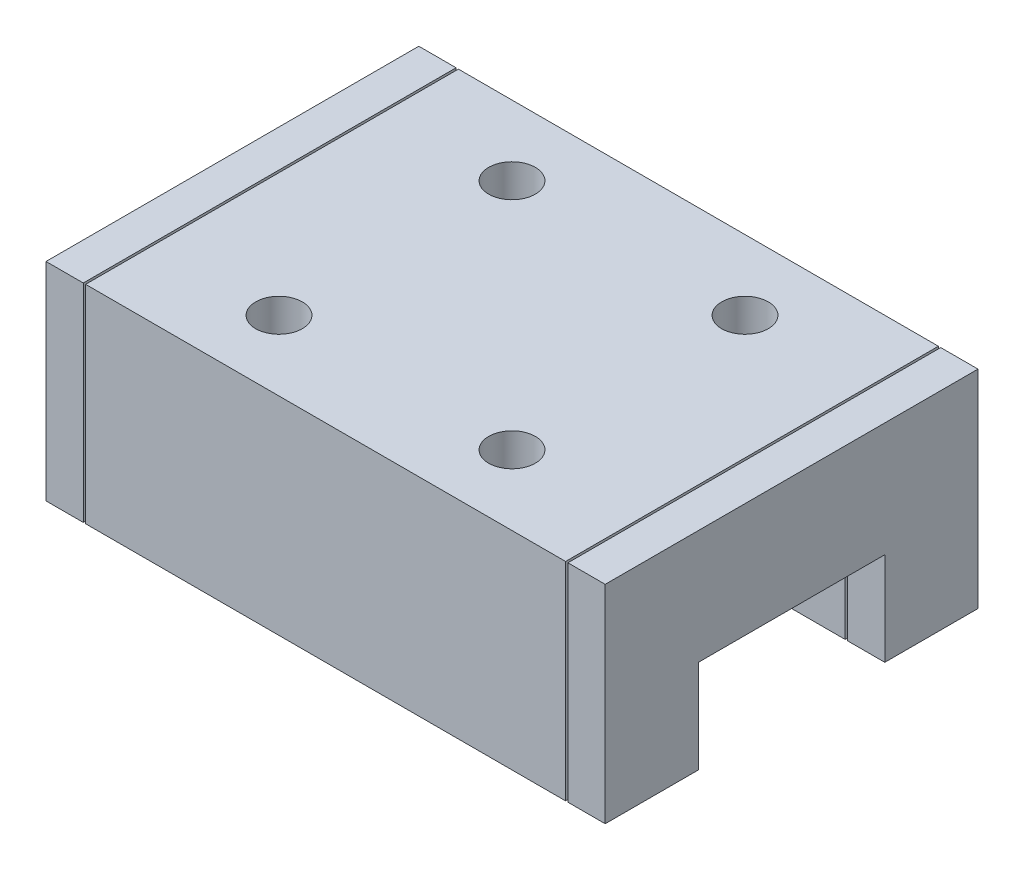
ISO-10303-21;
HEADER;
FILE_DESCRIPTION(('STEP AP214'),'2;1');
FILE_NAME('part.step','',(''),(''),'','','');
FILE_SCHEMA(('AUTOMOTIVE_DESIGN { 1 0 10303 214 1 1 1 1 }'));
ENDSEC;
DATA;
#1=APPLICATION_CONTEXT('core data for automotive mechanical design processes');
#2=APPLICATION_PROTOCOL_DEFINITION('international standard','automotive_design',2000,#1);
#3=PRODUCT_CONTEXT('',#1,'mechanical');
#4=PRODUCT('Part','Part','',(#3));
#5=PRODUCT_RELATED_PRODUCT_CATEGORY('part','',(#4));
#6=PRODUCT_DEFINITION_FORMATION('','',#4);
#7=PRODUCT_DEFINITION_CONTEXT('part definition',#1,'design');
#8=PRODUCT_DEFINITION('design','',#6,#7);
#9=PRODUCT_DEFINITION_SHAPE('','',#8);
#10=(LENGTH_UNIT() NAMED_UNIT(*) SI_UNIT(.MILLI.,.METRE.));
#11=(NAMED_UNIT(*) PLANE_ANGLE_UNIT() SI_UNIT($,.RADIAN.));
#12=(NAMED_UNIT(*) SI_UNIT($,.STERADIAN.) SOLID_ANGLE_UNIT());
#13=UNCERTAINTY_MEASURE_WITH_UNIT(LENGTH_MEASURE(1.E-05),#10,'distance_accuracy_value','');
#14=(GEOMETRIC_REPRESENTATION_CONTEXT(3) GLOBAL_UNCERTAINTY_ASSIGNED_CONTEXT((#13)) GLOBAL_UNIT_ASSIGNED_CONTEXT((#10,
#11,#12)) REPRESENTATION_CONTEXT('',''));
#15=CARTESIAN_POINT('',(0.,0.,0.));
#16=DIRECTION('',(0.,0.,1.));
#17=DIRECTION('',(1.,0.,0.));
#18=AXIS2_PLACEMENT_3D('',#15,#16,#17);
#19=CARTESIAN_POINT('',(12.,2.1,-8.));
#20=DIRECTION('',(0.,-1.,0.));
#21=DIRECTION('',(0.,0.,-1.));
#22=AXIS2_PLACEMENT_3D('',#19,#20,#21);
#23=PLANE('',#22);
#24=DIRECTION('',(-1.,0.,0.));
#25=VECTOR('',#24,1.);
#26=CARTESIAN_POINT('',(12.,2.1,-8.));
#27=LINE('',#26,#25);
#28=CARTESIAN_POINT('',(10.3,2.1,-8.));
#29=VERTEX_POINT('',#28);
#30=CARTESIAN_POINT('',(-10.3,2.1,-8.));
#31=VERTEX_POINT('',#30);
#32=EDGE_CURVE('P0_E84',#29,#31,#27,.T.);
#33=ORIENTED_EDGE('',*,*,#32,.F.);
#34=DIRECTION('',(0.,0.,1.));
#35=VECTOR('',#34,1.);
#36=CARTESIAN_POINT('',(10.3,2.1,8.));
#37=LINE('',#36,#35);
#38=CARTESIAN_POINT('',(10.3,2.1,-4.));
#39=VERTEX_POINT('',#38);
#40=EDGE_CURVE('P0_E155',#29,#39,#37,.T.);
#41=ORIENTED_EDGE('',*,*,#40,.T.);
#42=DIRECTION('',(1.,0.,0.));
#43=VECTOR('',#42,1.);
#44=CARTESIAN_POINT('',(12.,2.1,-4.));
#45=LINE('',#44,#43);
#46=CARTESIAN_POINT('',(-10.3,2.1,-4.));
#47=VERTEX_POINT('',#46);
#48=EDGE_CURVE('P0_E79',#47,#39,#45,.T.);
#49=ORIENTED_EDGE('',*,*,#48,.F.);
#50=DIRECTION('',(0.,0.,-1.));
#51=VECTOR('',#50,1.);
#52=CARTESIAN_POINT('',(-10.3,2.1,-8.));
#53=LINE('',#52,#51);
#54=EDGE_CURVE('P0_E82',#47,#31,#53,.T.);
#55=ORIENTED_EDGE('',*,*,#54,.T.);
#56=EDGE_LOOP('',(#33,#41,#49,#55));
#57=FACE_BOUND('',#56,.T.);
#58=ADVANCED_FACE('P0_F16',(#57),#23,.T.);
#59=CARTESIAN_POINT('',(12.,2.1,-4.));
#60=DIRECTION('',(0.,0.,1.));
#61=DIRECTION('',(1.,0.,0.));
#62=AXIS2_PLACEMENT_3D('',#59,#60,#61);
#63=PLANE('',#62);
#64=ORIENTED_EDGE('',*,*,#48,.T.);
#65=DIRECTION('',(0.,1.,0.));
#66=VECTOR('',#65,1.);
#67=CARTESIAN_POINT('',(10.3,0.,-4.));
#68=LINE('',#67,#66);
#69=CARTESIAN_POINT('',(10.3,6.1,-4.));
#70=VERTEX_POINT('',#69);
#71=EDGE_CURVE('P0_E153',#39,#70,#68,.T.);
#72=ORIENTED_EDGE('',*,*,#71,.T.);
#73=DIRECTION('',(1.,0.,0.));
#74=VECTOR('',#73,1.);
#75=CARTESIAN_POINT('',(12.,6.1,-4.));
#76=LINE('',#75,#74);
#77=CARTESIAN_POINT('',(-10.3,6.1,-4.));
#78=VERTEX_POINT('',#77);
#79=EDGE_CURVE('P0_E116',#78,#70,#76,.T.);
#80=ORIENTED_EDGE('',*,*,#79,.F.);
#81=DIRECTION('',(0.,1.,0.));
#82=VECTOR('',#81,1.);
#83=CARTESIAN_POINT('',(-10.3,0.,-4.));
#84=LINE('',#83,#82);
#85=EDGE_CURVE('P0_E162',#78,#47,#84,.F.);
#86=ORIENTED_EDGE('',*,*,#85,.T.);
#87=EDGE_LOOP('',(#64,#72,#80,#86));
#88=FACE_BOUND('',#87,.T.);
#89=ADVANCED_FACE('P0_F190',(#88),#63,.T.);
#90=CARTESIAN_POINT('',(12.,6.1,-4.));
#91=DIRECTION('',(0.,-1.,0.));
#92=DIRECTION('',(0.,0.,-1.));
#93=AXIS2_PLACEMENT_3D('',#90,#91,#92);
#94=PLANE('',#93);
#95=ORIENTED_EDGE('',*,*,#79,.T.);
#96=DIRECTION('',(0.,0.,1.));
#97=VECTOR('',#96,1.);
#98=CARTESIAN_POINT('',(10.3,6.1,8.));
#99=LINE('',#98,#97);
#100=CARTESIAN_POINT('',(10.3,6.1,4.));
#101=VERTEX_POINT('',#100);
#102=EDGE_CURVE('P0_E151',#70,#101,#99,.T.);
#103=ORIENTED_EDGE('',*,*,#102,.T.);
#104=DIRECTION('',(-1.,0.,0.));
#105=VECTOR('',#104,1.);
#106=CARTESIAN_POINT('',(12.,6.1,4.));
#107=LINE('',#106,#105);
#108=CARTESIAN_POINT('',(-10.3,6.1,4.));
#109=VERTEX_POINT('',#108);
#110=EDGE_CURVE('P0_E113',#109,#101,#107,.F.);
#111=ORIENTED_EDGE('',*,*,#110,.F.);
#112=DIRECTION('',(0.,0.,-1.));
#113=VECTOR('',#112,1.);
#114=CARTESIAN_POINT('',(-10.3,6.1,-8.));
#115=LINE('',#114,#113);
#116=EDGE_CURVE('P0_E164',#109,#78,#115,.T.);
#117=ORIENTED_EDGE('',*,*,#116,.T.);
#118=EDGE_LOOP('',(#95,#103,#111,#117));
#119=FACE_BOUND('',#118,.T.);
#120=ADVANCED_FACE('P0_F172',(#119),#94,.T.);
#121=CARTESIAN_POINT('',(12.,6.1,4.));
#122=DIRECTION('',(0.,0.,-1.));
#123=DIRECTION('',(-1.,0.,0.));
#124=AXIS2_PLACEMENT_3D('',#121,#122,#123);
#125=PLANE('',#124);
#126=ORIENTED_EDGE('',*,*,#110,.T.);
#127=DIRECTION('',(0.,1.,0.));
#128=VECTOR('',#127,1.);
#129=CARTESIAN_POINT('',(10.3,0.,4.));
#130=LINE('',#129,#128);
#131=CARTESIAN_POINT('',(10.3,2.1,4.));
#132=VERTEX_POINT('',#131);
#133=EDGE_CURVE('P0_E149',#101,#132,#130,.F.);
#134=ORIENTED_EDGE('',*,*,#133,.T.);
#135=DIRECTION('',(1.,0.,0.));
#136=VECTOR('',#135,1.);
#137=CARTESIAN_POINT('',(12.,2.1,4.));
#138=LINE('',#137,#136);
#139=CARTESIAN_POINT('',(-10.3,2.1,4.));
#140=VERTEX_POINT('',#139);
#141=EDGE_CURVE('P0_E97',#140,#132,#138,.T.);
#142=ORIENTED_EDGE('',*,*,#141,.F.);
#143=DIRECTION('',(0.,1.,0.));
#144=VECTOR('',#143,1.);
#145=CARTESIAN_POINT('',(-10.3,0.,4.));
#146=LINE('',#145,#144);
#147=EDGE_CURVE('P0_E107',#140,#109,#146,.T.);
#148=ORIENTED_EDGE('',*,*,#147,.T.);
#149=EDGE_LOOP('',(#126,#134,#142,#148));
#150=FACE_BOUND('',#149,.T.);
#151=ADVANCED_FACE('P0_F169',(#150),#125,.T.);
#152=CARTESIAN_POINT('',(12.,2.1,4.));
#153=DIRECTION('',(0.,-1.,0.));
#154=DIRECTION('',(0.,0.,-1.));
#155=AXIS2_PLACEMENT_3D('',#152,#153,#154);
#156=PLANE('',#155);
#157=ORIENTED_EDGE('',*,*,#141,.T.);
#158=DIRECTION('',(0.,0.,1.));
#159=VECTOR('',#158,1.);
#160=CARTESIAN_POINT('',(10.3,2.1,8.));
#161=LINE('',#160,#159);
#162=CARTESIAN_POINT('',(10.3,2.1,8.));
#163=VERTEX_POINT('',#162);
#164=EDGE_CURVE('P0_E143',#132,#163,#161,.T.);
#165=ORIENTED_EDGE('',*,*,#164,.T.);
#166=DIRECTION('',(1.,0.,0.));
#167=VECTOR('',#166,1.);
#168=CARTESIAN_POINT('',(12.,2.1,8.));
#169=LINE('',#168,#167);
#170=CARTESIAN_POINT('',(-10.3,2.1,8.));
#171=VERTEX_POINT('',#170);
#172=EDGE_CURVE('P0_E157',#171,#163,#169,.T.);
#173=ORIENTED_EDGE('',*,*,#172,.F.);
#174=DIRECTION('',(0.,0.,-1.));
#175=VECTOR('',#174,1.);
#176=CARTESIAN_POINT('',(-10.3,2.1,-8.));
#177=LINE('',#176,#175);
#178=EDGE_CURVE('P0_E104',#171,#140,#177,.T.);
#179=ORIENTED_EDGE('',*,*,#178,.T.);
#180=EDGE_LOOP('',(#157,#165,#173,#179));
#181=FACE_BOUND('',#180,.T.);
#182=ADVANCED_FACE('P0_F179',(#181),#156,.T.);
#183=CARTESIAN_POINT('',(12.,8.5,8.));
#184=DIRECTION('',(0.,1.,0.));
#185=DIRECTION('',(0.,0.,1.));
#186=AXIS2_PLACEMENT_3D('',#183,#184,#185);
#187=PLANE('',#186);
#188=CARTESIAN_POINT('',(-5.,8.5,-5.));
#189=DIRECTION('',(0.,1.,0.));
#190=DIRECTION('',(0.,0.,1.));
#191=AXIS2_PLACEMENT_3D('',#188,#189,#190);
#192=CIRCLE('',#191,1.);
#193=CARTESIAN_POINT('',(-5.,8.5,-4.));
#194=VERTEX_POINT('',#193);
#195=EDGE_CURVE('P0_E19',#194,#194,#192,.T.);
#196=ORIENTED_EDGE('',*,*,#195,.T.);
#197=EDGE_LOOP('',(#196));
#198=FACE_BOUND('',#197,.T.);
#199=ADVANCED_FACE('P0_F240',(#198),#187,.T.);
#200=CARTESIAN_POINT('',(12.,8.5,8.));
#201=DIRECTION('',(0.,1.,0.));
#202=DIRECTION('',(0.,0.,1.));
#203=AXIS2_PLACEMENT_3D('',#200,#201,#202);
#204=PLANE('',#203);
#205=CARTESIAN_POINT('',(-5.,8.5,5.));
#206=DIRECTION('',(0.,1.,0.));
#207=DIRECTION('',(0.,0.,1.));
#208=AXIS2_PLACEMENT_3D('',#205,#206,#207);
#209=CIRCLE('',#208,1.);
#210=CARTESIAN_POINT('',(-5.,8.5,6.));
#211=VERTEX_POINT('',#210);
#212=EDGE_CURVE('P0_E135',#211,#211,#209,.T.);
#213=ORIENTED_EDGE('',*,*,#212,.T.);
#214=EDGE_LOOP('',(#213));
#215=FACE_BOUND('',#214,.T.);
#216=ADVANCED_FACE('P0_F236',(#215),#204,.T.);
#217=CARTESIAN_POINT('',(12.,8.5,8.));
#218=DIRECTION('',(0.,1.,0.));
#219=DIRECTION('',(0.,0.,1.));
#220=AXIS2_PLACEMENT_3D('',#217,#218,#219);
#221=PLANE('',#220);
#222=CARTESIAN_POINT('',(5.,8.5,-5.));
#223=DIRECTION('',(0.,1.,0.));
#224=DIRECTION('',(0.,0.,1.));
#225=AXIS2_PLACEMENT_3D('',#222,#223,#224);
#226=CIRCLE('',#225,1.);
#227=CARTESIAN_POINT('',(5.,8.5,-4.));
#228=VERTEX_POINT('',#227);
#229=EDGE_CURVE('P0_E133',#228,#228,#226,.T.);
#230=ORIENTED_EDGE('',*,*,#229,.T.);
#231=EDGE_LOOP('',(#230));
#232=FACE_BOUND('',#231,.T.);
#233=ADVANCED_FACE('P0_F232',(#232),#221,.T.);
#234=CARTESIAN_POINT('',(12.,8.5,8.));
#235=DIRECTION('',(0.,1.,0.));
#236=DIRECTION('',(0.,0.,1.));
#237=AXIS2_PLACEMENT_3D('',#234,#235,#236);
#238=PLANE('',#237);
#239=CARTESIAN_POINT('',(5.,8.5,5.));
#240=DIRECTION('',(0.,1.,0.));
#241=DIRECTION('',(0.,0.,1.));
#242=AXIS2_PLACEMENT_3D('',#239,#240,#241);
#243=CIRCLE('',#242,1.);
#244=CARTESIAN_POINT('',(5.,8.5,6.));
#245=VERTEX_POINT('',#244);
#246=EDGE_CURVE('P0_E129',#245,#245,#243,.T.);
#247=ORIENTED_EDGE('',*,*,#246,.T.);
#248=EDGE_LOOP('',(#247));
#249=FACE_BOUND('',#248,.T.);
#250=ADVANCED_FACE('P0_F229',(#249),#238,.T.);
#251=CARTESIAN_POINT('',(12.,11.,-8.));
#252=DIRECTION('',(0.,0.,-1.));
#253=DIRECTION('',(-1.,0.,0.));
#254=AXIS2_PLACEMENT_3D('',#251,#252,#253);
#255=PLANE('',#254);
#256=DIRECTION('',(1.,0.,0.));
#257=VECTOR('',#256,1.);
#258=CARTESIAN_POINT('',(12.,11.,-8.));
#259=LINE('',#258,#257);
#260=CARTESIAN_POINT('',(10.3,11.,-8.));
#261=VERTEX_POINT('',#260);
#262=CARTESIAN_POINT('',(-10.3,11.,-8.));
#263=VERTEX_POINT('',#262);
#264=EDGE_CURVE('P0_E132',#261,#263,#259,.F.);
#265=ORIENTED_EDGE('',*,*,#264,.F.);
#266=DIRECTION('',(0.,1.,0.));
#267=VECTOR('',#266,1.);
#268=CARTESIAN_POINT('',(10.3,0.,-8.));
#269=LINE('',#268,#267);
#270=EDGE_CURVE('P0_E95',#261,#29,#269,.F.);
#271=ORIENTED_EDGE('',*,*,#270,.T.);
#272=ORIENTED_EDGE('',*,*,#32,.T.);
#273=DIRECTION('',(0.,1.,0.));
#274=VECTOR('',#273,1.);
#275=CARTESIAN_POINT('',(-10.3,0.,-8.));
#276=LINE('',#275,#274);
#277=EDGE_CURVE('P0_E89',#31,#263,#276,.T.);
#278=ORIENTED_EDGE('',*,*,#277,.T.);
#279=EDGE_LOOP('',(#265,#271,#272,#278));
#280=FACE_BOUND('',#279,.T.);
#281=ADVANCED_FACE('P0_F92',(#280),#255,.T.);
#282=CARTESIAN_POINT('',(-10.3,0.,-8.));
#283=DIRECTION('',(1.,0.,0.));
#284=DIRECTION('',(0.,0.,-1.));
#285=AXIS2_PLACEMENT_3D('',#282,#283,#284);
#286=PLANE('',#285);
#287=ORIENTED_EDGE('',*,*,#116,.F.);
#288=ORIENTED_EDGE('',*,*,#147,.F.);
#289=ORIENTED_EDGE('',*,*,#178,.F.);
#290=DIRECTION('',(0.,1.,0.));
#291=VECTOR('',#290,1.);
#292=CARTESIAN_POINT('',(-10.3,2.1,8.));
#293=LINE('',#292,#291);
#294=CARTESIAN_POINT('',(-10.3,11.,8.));
#295=VERTEX_POINT('',#294);
#296=EDGE_CURVE('P0_E159',#295,#171,#293,.F.);
#297=ORIENTED_EDGE('',*,*,#296,.F.);
#298=DIRECTION('',(0.,0.,1.));
#299=VECTOR('',#298,1.);
#300=CARTESIAN_POINT('',(-10.3,11.,8.));
#301=LINE('',#300,#299);
#302=EDGE_CURVE('P0_E102',#263,#295,#301,.T.);
#303=ORIENTED_EDGE('',*,*,#302,.F.);
#304=ORIENTED_EDGE('',*,*,#277,.F.);
#305=ORIENTED_EDGE('',*,*,#54,.F.);
#306=ORIENTED_EDGE('',*,*,#85,.F.);
#307=EDGE_LOOP('',(#287,#288,#289,#297,#303,#304,#305,#306));
#308=FACE_BOUND('',#307,.T.);
#309=ADVANCED_FACE('P0_F100',(#308),#286,.F.);
#310=CARTESIAN_POINT('',(12.,2.1,8.));
#311=DIRECTION('',(0.,0.,1.));
#312=DIRECTION('',(1.,0.,0.));
#313=AXIS2_PLACEMENT_3D('',#310,#311,#312);
#314=PLANE('',#313);
#315=ORIENTED_EDGE('',*,*,#172,.T.);
#316=DIRECTION('',(0.,1.,0.));
#317=VECTOR('',#316,1.);
#318=CARTESIAN_POINT('',(10.3,0.,8.));
#319=LINE('',#318,#317);
#320=CARTESIAN_POINT('',(10.3,11.,8.));
#321=VERTEX_POINT('',#320);
#322=EDGE_CURVE('P0_E34',#163,#321,#319,.T.);
#323=ORIENTED_EDGE('',*,*,#322,.T.);
#324=DIRECTION('',(1.,0.,0.));
#325=VECTOR('',#324,1.);
#326=CARTESIAN_POINT('',(12.,11.,8.));
#327=LINE('',#326,#325);
#328=EDGE_CURVE('P0_E182',#295,#321,#327,.T.);
#329=ORIENTED_EDGE('',*,*,#328,.F.);
#330=ORIENTED_EDGE('',*,*,#296,.T.);
#331=EDGE_LOOP('',(#315,#323,#329,#330));
#332=FACE_BOUND('',#331,.T.);
#333=ADVANCED_FACE('P0_F183',(#332),#314,.T.);
#334=CARTESIAN_POINT('',(10.3,0.,8.));
#335=DIRECTION('',(-1.,0.,0.));
#336=DIRECTION('',(0.,0.,1.));
#337=AXIS2_PLACEMENT_3D('',#334,#335,#336);
#338=PLANE('',#337);
#339=DIRECTION('',(0.,0.,1.));
#340=VECTOR('',#339,1.);
#341=CARTESIAN_POINT('',(10.3,11.,8.));
#342=LINE('',#341,#340);
#343=EDGE_CURVE('P0_E128',#321,#261,#342,.F.);
#344=ORIENTED_EDGE('',*,*,#343,.F.);
#345=ORIENTED_EDGE('',*,*,#322,.F.);
#346=ORIENTED_EDGE('',*,*,#164,.F.);
#347=ORIENTED_EDGE('',*,*,#133,.F.);
#348=ORIENTED_EDGE('',*,*,#102,.F.);
#349=ORIENTED_EDGE('',*,*,#71,.F.);
#350=ORIENTED_EDGE('',*,*,#40,.F.);
#351=ORIENTED_EDGE('',*,*,#270,.F.);
#352=EDGE_LOOP('',(#344,#345,#346,#347,#348,#349,#350,#351));
#353=FACE_BOUND('',#352,.T.);
#354=ADVANCED_FACE('P0_F176',(#353),#338,.F.);
#355=CARTESIAN_POINT('',(-5.,11.,-5.));
#356=DIRECTION('',(0.,1.,0.));
#357=DIRECTION('',(0.,0.,1.));
#358=AXIS2_PLACEMENT_3D('',#355,#356,#357);
#359=CYLINDRICAL_SURFACE('',#358,1.);
#360=ORIENTED_EDGE('',*,*,#195,.F.);
#361=EDGE_LOOP('',(#360));
#362=FACE_BOUND('',#361,.T.);
#363=CARTESIAN_POINT('',(-5.,11.,-5.));
#364=DIRECTION('',(0.,1.,0.));
#365=DIRECTION('',(0.,0.,1.));
#366=AXIS2_PLACEMENT_3D('',#363,#364,#365);
#367=CIRCLE('',#366,1.);
#368=CARTESIAN_POINT('',(-5.,11.,-4.));
#369=VERTEX_POINT('',#368);
#370=EDGE_CURVE('P0_E125',#369,#369,#367,.F.);
#371=ORIENTED_EDGE('',*,*,#370,.F.);
#372=EDGE_LOOP('',(#371));
#373=FACE_BOUND('',#372,.T.);
#374=ADVANCED_FACE('P0_F216',(#362,#373),#359,.F.);
#375=CARTESIAN_POINT('',(-5.,11.,5.));
#376=DIRECTION('',(0.,1.,0.));
#377=DIRECTION('',(0.,0.,1.));
#378=AXIS2_PLACEMENT_3D('',#375,#376,#377);
#379=CYLINDRICAL_SURFACE('',#378,1.);
#380=ORIENTED_EDGE('',*,*,#212,.F.);
#381=EDGE_LOOP('',(#380));
#382=FACE_BOUND('',#381,.T.);
#383=CARTESIAN_POINT('',(-5.,11.,5.));
#384=DIRECTION('',(0.,1.,0.));
#385=DIRECTION('',(0.,0.,1.));
#386=AXIS2_PLACEMENT_3D('',#383,#384,#385);
#387=CIRCLE('',#386,1.);
#388=CARTESIAN_POINT('',(-5.,11.,6.));
#389=VERTEX_POINT('',#388);
#390=EDGE_CURVE('P0_E122',#389,#389,#387,.F.);
#391=ORIENTED_EDGE('',*,*,#390,.F.);
#392=EDGE_LOOP('',(#391));
#393=FACE_BOUND('',#392,.T.);
#394=ADVANCED_FACE('P0_F212',(#382,#393),#379,.F.);
#395=CARTESIAN_POINT('',(5.,11.,-5.));
#396=DIRECTION('',(0.,1.,0.));
#397=DIRECTION('',(0.,0.,1.));
#398=AXIS2_PLACEMENT_3D('',#395,#396,#397);
#399=CYLINDRICAL_SURFACE('',#398,1.);
#400=ORIENTED_EDGE('',*,*,#229,.F.);
#401=EDGE_LOOP('',(#400));
#402=FACE_BOUND('',#401,.T.);
#403=CARTESIAN_POINT('',(5.,11.,-5.));
#404=DIRECTION('',(0.,1.,0.));
#405=DIRECTION('',(0.,0.,1.));
#406=AXIS2_PLACEMENT_3D('',#403,#404,#405);
#407=CIRCLE('',#406,1.);
#408=CARTESIAN_POINT('',(5.,11.,-4.));
#409=VERTEX_POINT('',#408);
#410=EDGE_CURVE('P0_E25',#409,#409,#407,.F.);
#411=ORIENTED_EDGE('',*,*,#410,.F.);
#412=EDGE_LOOP('',(#411));
#413=FACE_BOUND('',#412,.T.);
#414=ADVANCED_FACE('P0_F205',(#402,#413),#399,.F.);
#415=CARTESIAN_POINT('',(5.,11.,5.));
#416=DIRECTION('',(0.,1.,0.));
#417=DIRECTION('',(0.,0.,1.));
#418=AXIS2_PLACEMENT_3D('',#415,#416,#417);
#419=CYLINDRICAL_SURFACE('',#418,1.);
#420=ORIENTED_EDGE('',*,*,#246,.F.);
#421=EDGE_LOOP('',(#420));
#422=FACE_BOUND('',#421,.T.);
#423=CARTESIAN_POINT('',(5.,11.,5.));
#424=DIRECTION('',(0.,1.,0.));
#425=DIRECTION('',(0.,0.,1.));
#426=AXIS2_PLACEMENT_3D('',#423,#424,#425);
#427=CIRCLE('',#426,1.);
#428=CARTESIAN_POINT('',(5.,11.,6.));
#429=VERTEX_POINT('',#428);
#430=EDGE_CURVE('P0_E11',#429,#429,#427,.F.);
#431=ORIENTED_EDGE('',*,*,#430,.F.);
#432=EDGE_LOOP('',(#431));
#433=FACE_BOUND('',#432,.T.);
#434=ADVANCED_FACE('P0_F199',(#422,#433),#419,.F.);
#435=CARTESIAN_POINT('',(12.,11.,8.));
#436=DIRECTION('',(0.,1.,0.));
#437=DIRECTION('',(0.,0.,1.));
#438=AXIS2_PLACEMENT_3D('',#435,#436,#437);
#439=PLANE('',#438);
#440=ORIENTED_EDGE('',*,*,#430,.T.);
#441=EDGE_LOOP('',(#440));
#442=FACE_BOUND('',#441,.T.);
#443=ORIENTED_EDGE('',*,*,#410,.T.);
#444=EDGE_LOOP('',(#443));
#445=FACE_BOUND('',#444,.T.);
#446=ORIENTED_EDGE('',*,*,#390,.T.);
#447=EDGE_LOOP('',(#446));
#448=FACE_BOUND('',#447,.T.);
#449=ORIENTED_EDGE('',*,*,#370,.T.);
#450=EDGE_LOOP('',(#449));
#451=FACE_BOUND('',#450,.T.);
#452=ORIENTED_EDGE('',*,*,#328,.T.);
#453=ORIENTED_EDGE('',*,*,#343,.T.);
#454=ORIENTED_EDGE('',*,*,#264,.T.);
#455=ORIENTED_EDGE('',*,*,#302,.T.);
#456=EDGE_LOOP('',(#452,#453,#454,#455));
#457=FACE_BOUND('',#456,.T.);
#458=ADVANCED_FACE('P0_F187',(#442,#445,#448,#451,#457),#439,.T.);
#459=CLOSED_SHELL('',(#58,#89,#120,#151,#182,#199,#216,#233,#250,#281,#309,#333,#354,#374,#394,
#414,#434,#458));
#460=MANIFOLD_SOLID_BREP('P0_B1',#459);
#461=CARTESIAN_POINT('',(10.4,0.,-8.));
#462=DIRECTION('',(1.,0.,0.));
#463=DIRECTION('',(0.,0.,-1.));
#464=AXIS2_PLACEMENT_3D('',#461,#462,#463);
#465=PLANE('',#464);
#466=DIRECTION('',(0.,0.,-1.));
#467=VECTOR('',#466,1.);
#468=CARTESIAN_POINT('',(10.4,6.1,-4.));
#469=LINE('',#468,#467);
#470=CARTESIAN_POINT('',(10.4,6.1,4.));
#471=VERTEX_POINT('',#470);
#472=CARTESIAN_POINT('',(10.4,6.1,-4.));
#473=VERTEX_POINT('',#472);
#474=EDGE_CURVE('P1_E99',#471,#473,#469,.T.);
#475=ORIENTED_EDGE('',*,*,#474,.F.);
#476=DIRECTION('',(0.,1.,0.));
#477=VECTOR('',#476,1.);
#478=CARTESIAN_POINT('',(10.4,6.1,4.));
#479=LINE('',#478,#477);
#480=CARTESIAN_POINT('',(10.4,2.1,4.));
#481=VERTEX_POINT('',#480);
#482=EDGE_CURVE('P1_E103',#481,#471,#479,.T.);
#483=ORIENTED_EDGE('',*,*,#482,.F.);
#484=DIRECTION('',(0.,0.,-1.));
#485=VECTOR('',#484,1.);
#486=CARTESIAN_POINT('',(10.4,2.1,4.));
#487=LINE('',#486,#485);
#488=CARTESIAN_POINT('',(10.4,2.1,8.));
#489=VERTEX_POINT('',#488);
#490=EDGE_CURVE('P1_E108',#489,#481,#487,.T.);
#491=ORIENTED_EDGE('',*,*,#490,.F.);
#492=DIRECTION('',(0.,1.,0.));
#493=VECTOR('',#492,1.);
#494=CARTESIAN_POINT('',(10.4,2.1,8.));
#495=LINE('',#494,#493);
#496=CARTESIAN_POINT('',(10.4,11.,8.));
#497=VERTEX_POINT('',#496);
#498=EDGE_CURVE('P1_E113',#497,#489,#495,.F.);
#499=ORIENTED_EDGE('',*,*,#498,.F.);
#500=DIRECTION('',(0.,0.,1.));
#501=VECTOR('',#500,1.);
#502=CARTESIAN_POINT('',(10.4,11.,8.));
#503=LINE('',#502,#501);
#504=CARTESIAN_POINT('',(10.4,11.,-8.));
#505=VERTEX_POINT('',#504);
#506=EDGE_CURVE('P1_E118',#505,#497,#503,.T.);
#507=ORIENTED_EDGE('',*,*,#506,.F.);
#508=DIRECTION('',(0.,1.,0.));
#509=VECTOR('',#508,1.);
#510=CARTESIAN_POINT('',(10.4,11.,-8.));
#511=LINE('',#510,#509);
#512=CARTESIAN_POINT('',(10.4,2.1,-8.));
#513=VERTEX_POINT('',#512);
#514=EDGE_CURVE('P1_E81',#513,#505,#511,.T.);
#515=ORIENTED_EDGE('',*,*,#514,.F.);
#516=DIRECTION('',(0.,0.,-1.));
#517=VECTOR('',#516,1.);
#518=CARTESIAN_POINT('',(10.4,2.1,-8.));
#519=LINE('',#518,#517);
#520=CARTESIAN_POINT('',(10.4,2.1,-4.));
#521=VERTEX_POINT('',#520);
#522=EDGE_CURVE('P1_E19',#521,#513,#519,.T.);
#523=ORIENTED_EDGE('',*,*,#522,.F.);
#524=DIRECTION('',(0.,1.,0.));
#525=VECTOR('',#524,1.);
#526=CARTESIAN_POINT('',(10.4,2.1,-4.));
#527=LINE('',#526,#525);
#528=EDGE_CURVE('P1_E78',#473,#521,#527,.F.);
#529=ORIENTED_EDGE('',*,*,#528,.F.);
#530=EDGE_LOOP('',(#475,#483,#491,#499,#507,#515,#523,#529));
#531=FACE_BOUND('',#530,.T.);
#532=ADVANCED_FACE('P1_F16',(#531),#465,.F.);
#533=CARTESIAN_POINT('',(12.,2.1,-8.));
#534=DIRECTION('',(0.,-1.,0.));
#535=DIRECTION('',(0.,0.,-1.));
#536=AXIS2_PLACEMENT_3D('',#533,#534,#535);
#537=PLANE('',#536);
#538=DIRECTION('',(1.,0.,0.));
#539=VECTOR('',#538,1.);
#540=CARTESIAN_POINT('',(12.,2.1,-4.));
#541=LINE('',#540,#539);
#542=CARTESIAN_POINT('',(12.,2.1,-4.));
#543=VERTEX_POINT('',#542);
#544=EDGE_CURVE('P1_E86',#521,#543,#541,.T.);
#545=ORIENTED_EDGE('',*,*,#544,.F.);
#546=ORIENTED_EDGE('',*,*,#522,.T.);
#547=DIRECTION('',(-1.,0.,0.));
#548=VECTOR('',#547,1.);
#549=CARTESIAN_POINT('',(12.,2.1,-8.));
#550=LINE('',#549,#548);
#551=CARTESIAN_POINT('',(12.,2.1,-8.));
#552=VERTEX_POINT('',#551);
#553=EDGE_CURVE('P1_E122',#552,#513,#550,.T.);
#554=ORIENTED_EDGE('',*,*,#553,.F.);
#555=DIRECTION('',(0.,0.,1.));
#556=VECTOR('',#555,1.);
#557=CARTESIAN_POINT('',(12.,2.1,0.));
#558=LINE('',#557,#556);
#559=EDGE_CURVE('P1_E96',#552,#543,#558,.T.);
#560=ORIENTED_EDGE('',*,*,#559,.T.);
#561=EDGE_LOOP('',(#545,#546,#554,#560));
#562=FACE_BOUND('',#561,.T.);
#563=ADVANCED_FACE('P1_F95',(#562),#537,.T.);
#564=CARTESIAN_POINT('',(12.,2.1,-4.));
#565=DIRECTION('',(0.,0.,1.));
#566=DIRECTION('',(1.,0.,0.));
#567=AXIS2_PLACEMENT_3D('',#564,#565,#566);
#568=PLANE('',#567);
#569=DIRECTION('',(1.,0.,0.));
#570=VECTOR('',#569,1.);
#571=CARTESIAN_POINT('',(12.,6.1,-4.));
#572=LINE('',#571,#570);
#573=CARTESIAN_POINT('',(12.,6.1,-4.));
#574=VERTEX_POINT('',#573);
#575=EDGE_CURVE('P1_E92',#473,#574,#572,.T.);
#576=ORIENTED_EDGE('',*,*,#575,.F.);
#577=ORIENTED_EDGE('',*,*,#528,.T.);
#578=ORIENTED_EDGE('',*,*,#544,.T.);
#579=DIRECTION('',(0.,1.,0.));
#580=VECTOR('',#579,1.);
#581=CARTESIAN_POINT('',(12.,0.,-4.));
#582=LINE('',#581,#580);
#583=EDGE_CURVE('P1_E126',#543,#574,#582,.T.);
#584=ORIENTED_EDGE('',*,*,#583,.T.);
#585=EDGE_LOOP('',(#576,#577,#578,#584));
#586=FACE_BOUND('',#585,.T.);
#587=ADVANCED_FACE('P1_F89',(#586),#568,.T.);
#588=CARTESIAN_POINT('',(12.,6.1,-4.));
#589=DIRECTION('',(0.,-1.,0.));
#590=DIRECTION('',(0.,0.,-1.));
#591=AXIS2_PLACEMENT_3D('',#588,#589,#590);
#592=PLANE('',#591);
#593=DIRECTION('',(-1.,0.,0.));
#594=VECTOR('',#593,1.);
#595=CARTESIAN_POINT('',(12.,6.1,4.));
#596=LINE('',#595,#594);
#597=CARTESIAN_POINT('',(12.,6.1,4.));
#598=VERTEX_POINT('',#597);
#599=EDGE_CURVE('P1_E101',#471,#598,#596,.F.);
#600=ORIENTED_EDGE('',*,*,#599,.F.);
#601=ORIENTED_EDGE('',*,*,#474,.T.);
#602=ORIENTED_EDGE('',*,*,#575,.T.);
#603=DIRECTION('',(0.,0.,1.));
#604=VECTOR('',#603,1.);
#605=CARTESIAN_POINT('',(12.,6.1,0.));
#606=LINE('',#605,#604);
#607=EDGE_CURVE('P1_E128',#574,#598,#606,.T.);
#608=ORIENTED_EDGE('',*,*,#607,.T.);
#609=EDGE_LOOP('',(#600,#601,#602,#608));
#610=FACE_BOUND('',#609,.T.);
#611=ADVANCED_FACE('P1_F161',(#610),#592,.T.);
#612=CARTESIAN_POINT('',(12.,6.1,4.));
#613=DIRECTION('',(0.,0.,-1.));
#614=DIRECTION('',(-1.,0.,0.));
#615=AXIS2_PLACEMENT_3D('',#612,#613,#614);
#616=PLANE('',#615);
#617=DIRECTION('',(1.,0.,0.));
#618=VECTOR('',#617,1.);
#619=CARTESIAN_POINT('',(12.,2.1,4.));
#620=LINE('',#619,#618);
#621=CARTESIAN_POINT('',(12.,2.1,4.));
#622=VERTEX_POINT('',#621);
#623=EDGE_CURVE('P1_E106',#481,#622,#620,.T.);
#624=ORIENTED_EDGE('',*,*,#623,.F.);
#625=ORIENTED_EDGE('',*,*,#482,.T.);
#626=ORIENTED_EDGE('',*,*,#599,.T.);
#627=DIRECTION('',(0.,1.,0.));
#628=VECTOR('',#627,1.);
#629=CARTESIAN_POINT('',(12.,0.,4.));
#630=LINE('',#629,#628);
#631=EDGE_CURVE('P1_E131',#598,#622,#630,.F.);
#632=ORIENTED_EDGE('',*,*,#631,.T.);
#633=EDGE_LOOP('',(#624,#625,#626,#632));
#634=FACE_BOUND('',#633,.T.);
#635=ADVANCED_FACE('P1_F158',(#634),#616,.T.);
#636=CARTESIAN_POINT('',(12.,2.1,4.));
#637=DIRECTION('',(0.,-1.,0.));
#638=DIRECTION('',(0.,0.,-1.));
#639=AXIS2_PLACEMENT_3D('',#636,#637,#638);
#640=PLANE('',#639);
#641=DIRECTION('',(1.,0.,0.));
#642=VECTOR('',#641,1.);
#643=CARTESIAN_POINT('',(12.,2.1,8.));
#644=LINE('',#643,#642);
#645=CARTESIAN_POINT('',(12.,2.1,8.));
#646=VERTEX_POINT('',#645);
#647=EDGE_CURVE('P1_E111',#489,#646,#644,.T.);
#648=ORIENTED_EDGE('',*,*,#647,.F.);
#649=ORIENTED_EDGE('',*,*,#490,.T.);
#650=ORIENTED_EDGE('',*,*,#623,.T.);
#651=DIRECTION('',(0.,0.,1.));
#652=VECTOR('',#651,1.);
#653=CARTESIAN_POINT('',(12.,2.1,0.));
#654=LINE('',#653,#652);
#655=EDGE_CURVE('P1_E134',#622,#646,#654,.T.);
#656=ORIENTED_EDGE('',*,*,#655,.T.);
#657=EDGE_LOOP('',(#648,#649,#650,#656));
#658=FACE_BOUND('',#657,.T.);
#659=ADVANCED_FACE('P1_F153',(#658),#640,.T.);
#660=CARTESIAN_POINT('',(12.,2.1,8.));
#661=DIRECTION('',(0.,0.,1.));
#662=DIRECTION('',(1.,0.,0.));
#663=AXIS2_PLACEMENT_3D('',#660,#661,#662);
#664=PLANE('',#663);
#665=DIRECTION('',(1.,0.,0.));
#666=VECTOR('',#665,1.);
#667=CARTESIAN_POINT('',(12.,11.,8.));
#668=LINE('',#667,#666);
#669=CARTESIAN_POINT('',(12.,11.,8.));
#670=VERTEX_POINT('',#669);
#671=EDGE_CURVE('P1_E116',#497,#670,#668,.T.);
#672=ORIENTED_EDGE('',*,*,#671,.F.);
#673=ORIENTED_EDGE('',*,*,#498,.T.);
#674=ORIENTED_EDGE('',*,*,#647,.T.);
#675=DIRECTION('',(0.,1.,0.));
#676=VECTOR('',#675,1.);
#677=CARTESIAN_POINT('',(12.,0.,8.));
#678=LINE('',#677,#676);
#679=EDGE_CURVE('P1_E137',#646,#670,#678,.T.);
#680=ORIENTED_EDGE('',*,*,#679,.T.);
#681=EDGE_LOOP('',(#672,#673,#674,#680));
#682=FACE_BOUND('',#681,.T.);
#683=ADVANCED_FACE('P1_F150',(#682),#664,.T.);
#684=CARTESIAN_POINT('',(12.,11.,8.));
#685=DIRECTION('',(0.,1.,0.));
#686=DIRECTION('',(0.,0.,1.));
#687=AXIS2_PLACEMENT_3D('',#684,#685,#686);
#688=PLANE('',#687);
#689=DIRECTION('',(-1.,0.,0.));
#690=VECTOR('',#689,1.);
#691=CARTESIAN_POINT('',(12.,11.,-8.));
#692=LINE('',#691,#690);
#693=CARTESIAN_POINT('',(12.,11.,-8.));
#694=VERTEX_POINT('',#693);
#695=EDGE_CURVE('P1_E33',#505,#694,#692,.F.);
#696=ORIENTED_EDGE('',*,*,#695,.F.);
#697=ORIENTED_EDGE('',*,*,#506,.T.);
#698=ORIENTED_EDGE('',*,*,#671,.T.);
#699=DIRECTION('',(0.,0.,1.));
#700=VECTOR('',#699,1.);
#701=CARTESIAN_POINT('',(12.,11.,0.));
#702=LINE('',#701,#700);
#703=EDGE_CURVE('P1_E25',#670,#694,#702,.F.);
#704=ORIENTED_EDGE('',*,*,#703,.T.);
#705=EDGE_LOOP('',(#696,#697,#698,#704));
#706=FACE_BOUND('',#705,.T.);
#707=ADVANCED_FACE('P1_F143',(#706),#688,.T.);
#708=CARTESIAN_POINT('',(12.,11.,-8.));
#709=DIRECTION('',(0.,0.,-1.));
#710=DIRECTION('',(-1.,0.,0.));
#711=AXIS2_PLACEMENT_3D('',#708,#709,#710);
#712=PLANE('',#711);
#713=ORIENTED_EDGE('',*,*,#553,.T.);
#714=ORIENTED_EDGE('',*,*,#514,.T.);
#715=ORIENTED_EDGE('',*,*,#695,.T.);
#716=DIRECTION('',(0.,1.,0.));
#717=VECTOR('',#716,1.);
#718=CARTESIAN_POINT('',(12.,0.,-8.));
#719=LINE('',#718,#717);
#720=EDGE_CURVE('P1_E11',#694,#552,#719,.F.);
#721=ORIENTED_EDGE('',*,*,#720,.T.);
#722=EDGE_LOOP('',(#713,#714,#715,#721));
#723=FACE_BOUND('',#722,.T.);
#724=ADVANCED_FACE('P1_F162',(#723),#712,.T.);
#725=CARTESIAN_POINT('',(12.,0.,0.));
#726=DIRECTION('',(-1.,0.,0.));
#727=DIRECTION('',(0.,0.,1.));
#728=AXIS2_PLACEMENT_3D('',#725,#726,#727);
#729=PLANE('',#728);
#730=ORIENTED_EDGE('',*,*,#703,.F.);
#731=ORIENTED_EDGE('',*,*,#679,.F.);
#732=ORIENTED_EDGE('',*,*,#655,.F.);
#733=ORIENTED_EDGE('',*,*,#631,.F.);
#734=ORIENTED_EDGE('',*,*,#607,.F.);
#735=ORIENTED_EDGE('',*,*,#583,.F.);
#736=ORIENTED_EDGE('',*,*,#559,.F.);
#737=ORIENTED_EDGE('',*,*,#720,.F.);
#738=EDGE_LOOP('',(#730,#731,#732,#733,#734,#735,#736,#737));
#739=FACE_BOUND('',#738,.T.);
#740=ADVANCED_FACE('P1_F147',(#739),#729,.F.);
#741=CLOSED_SHELL('',(#532,#563,#587,#611,#635,#659,#683,#707,#724,#740));
#742=MANIFOLD_SOLID_BREP('P1_B1',#741);
#743=CARTESIAN_POINT('',(-12.,0.,0.));
#744=DIRECTION('',(-1.,0.,0.));
#745=DIRECTION('',(0.,0.,1.));
#746=AXIS2_PLACEMENT_3D('',#743,#744,#745);
#747=PLANE('',#746);
#748=DIRECTION('',(0.,1.,0.));
#749=VECTOR('',#748,1.);
#750=CARTESIAN_POINT('',(-12.,11.,-8.));
#751=LINE('',#750,#749);
#752=CARTESIAN_POINT('',(-12.,2.1,-8.));
#753=VERTEX_POINT('',#752);
#754=CARTESIAN_POINT('',(-12.,11.,-8.));
#755=VERTEX_POINT('',#754);
#756=EDGE_CURVE('P2_E93',#753,#755,#751,.T.);
#757=ORIENTED_EDGE('',*,*,#756,.F.);
#758=DIRECTION('',(0.,0.,-1.));
#759=VECTOR('',#758,1.);
#760=CARTESIAN_POINT('',(-12.,2.1,-8.));
#761=LINE('',#760,#759);
#762=CARTESIAN_POINT('',(-12.,2.1,-4.));
#763=VERTEX_POINT('',#762);
#764=EDGE_CURVE('P2_E19',#763,#753,#761,.T.);
#765=ORIENTED_EDGE('',*,*,#764,.F.);
#766=DIRECTION('',(0.,1.,0.));
#767=VECTOR('',#766,1.);
#768=CARTESIAN_POINT('',(-12.,2.1,-4.));
#769=LINE('',#768,#767);
#770=CARTESIAN_POINT('',(-12.,6.1,-4.));
#771=VERTEX_POINT('',#770);
#772=EDGE_CURVE('P2_E82',#771,#763,#769,.F.);
#773=ORIENTED_EDGE('',*,*,#772,.F.);
#774=DIRECTION('',(0.,0.,-1.));
#775=VECTOR('',#774,1.);
#776=CARTESIAN_POINT('',(-12.,6.1,-4.));
#777=LINE('',#776,#775);
#778=CARTESIAN_POINT('',(-12.,6.1,4.));
#779=VERTEX_POINT('',#778);
#780=EDGE_CURVE('P2_E77',#779,#771,#777,.T.);
#781=ORIENTED_EDGE('',*,*,#780,.F.);
#782=DIRECTION('',(0.,1.,0.));
#783=VECTOR('',#782,1.);
#784=CARTESIAN_POINT('',(-12.,6.1,4.));
#785=LINE('',#784,#783);
#786=CARTESIAN_POINT('',(-12.,2.1,4.));
#787=VERTEX_POINT('',#786);
#788=EDGE_CURVE('P2_E104',#787,#779,#785,.T.);
#789=ORIENTED_EDGE('',*,*,#788,.F.);
#790=DIRECTION('',(0.,0.,-1.));
#791=VECTOR('',#790,1.);
#792=CARTESIAN_POINT('',(-12.,2.1,4.));
#793=LINE('',#792,#791);
#794=CARTESIAN_POINT('',(-12.,2.1,8.));
#795=VERTEX_POINT('',#794);
#796=EDGE_CURVE('P2_E108',#795,#787,#793,.T.);
#797=ORIENTED_EDGE('',*,*,#796,.F.);
#798=DIRECTION('',(0.,1.,0.));
#799=VECTOR('',#798,1.);
#800=CARTESIAN_POINT('',(-12.,2.1,8.));
#801=LINE('',#800,#799);
#802=CARTESIAN_POINT('',(-12.,11.,8.));
#803=VERTEX_POINT('',#802);
#804=EDGE_CURVE('P2_E112',#803,#795,#801,.F.);
#805=ORIENTED_EDGE('',*,*,#804,.F.);
#806=DIRECTION('',(0.,0.,1.));
#807=VECTOR('',#806,1.);
#808=CARTESIAN_POINT('',(-12.,11.,8.));
#809=LINE('',#808,#807);
#810=EDGE_CURVE('P2_E116',#755,#803,#809,.T.);
#811=ORIENTED_EDGE('',*,*,#810,.F.);
#812=EDGE_LOOP('',(#757,#765,#773,#781,#789,#797,#805,#811));
#813=FACE_BOUND('',#812,.T.);
#814=ADVANCED_FACE('P2_F16',(#813),#747,.T.);
#815=CARTESIAN_POINT('',(12.,2.1,-8.));
#816=DIRECTION('',(0.,-1.,0.));
#817=DIRECTION('',(0.,0.,-1.));
#818=AXIS2_PLACEMENT_3D('',#815,#816,#817);
#819=PLANE('',#818);
#820=DIRECTION('',(-1.,0.,0.));
#821=VECTOR('',#820,1.);
#822=CARTESIAN_POINT('',(12.,2.1,-8.));
#823=LINE('',#822,#821);
#824=CARTESIAN_POINT('',(-10.4,2.1,-8.));
#825=VERTEX_POINT('',#824);
#826=EDGE_CURVE('P2_E120',#825,#753,#823,.T.);
#827=ORIENTED_EDGE('',*,*,#826,.F.);
#828=DIRECTION('',(0.,0.,1.));
#829=VECTOR('',#828,1.);
#830=CARTESIAN_POINT('',(-10.4,2.1,8.));
#831=LINE('',#830,#829);
#832=CARTESIAN_POINT('',(-10.4,2.1,-4.));
#833=VERTEX_POINT('',#832);
#834=EDGE_CURVE('P2_E99',#825,#833,#831,.T.);
#835=ORIENTED_EDGE('',*,*,#834,.T.);
#836=DIRECTION('',(1.,0.,0.));
#837=VECTOR('',#836,1.);
#838=CARTESIAN_POINT('',(12.,2.1,-4.));
#839=LINE('',#838,#837);
#840=EDGE_CURVE('P2_E87',#763,#833,#839,.T.);
#841=ORIENTED_EDGE('',*,*,#840,.F.);
#842=ORIENTED_EDGE('',*,*,#764,.T.);
#843=EDGE_LOOP('',(#827,#835,#841,#842));
#844=FACE_BOUND('',#843,.T.);
#845=ADVANCED_FACE('P2_F98',(#844),#819,.T.);
#846=CARTESIAN_POINT('',(12.,2.1,-4.));
#847=DIRECTION('',(0.,0.,1.));
#848=DIRECTION('',(1.,0.,0.));
#849=AXIS2_PLACEMENT_3D('',#846,#847,#848);
#850=PLANE('',#849);
#851=ORIENTED_EDGE('',*,*,#840,.T.);
#852=DIRECTION('',(0.,1.,0.));
#853=VECTOR('',#852,1.);
#854=CARTESIAN_POINT('',(-10.4,0.,-4.));
#855=LINE('',#854,#853);
#856=CARTESIAN_POINT('',(-10.4,6.1,-4.));
#857=VERTEX_POINT('',#856);
#858=EDGE_CURVE('P2_E125',#833,#857,#855,.T.);
#859=ORIENTED_EDGE('',*,*,#858,.T.);
#860=DIRECTION('',(1.,0.,0.));
#861=VECTOR('',#860,1.);
#862=CARTESIAN_POINT('',(12.,6.1,-4.));
#863=LINE('',#862,#861);
#864=EDGE_CURVE('P2_E89',#771,#857,#863,.T.);
#865=ORIENTED_EDGE('',*,*,#864,.F.);
#866=ORIENTED_EDGE('',*,*,#772,.T.);
#867=EDGE_LOOP('',(#851,#859,#865,#866));
#868=FACE_BOUND('',#867,.T.);
#869=ADVANCED_FACE('P2_F84',(#868),#850,.T.);
#870=CARTESIAN_POINT('',(12.,6.1,-4.));
#871=DIRECTION('',(0.,-1.,0.));
#872=DIRECTION('',(0.,0.,-1.));
#873=AXIS2_PLACEMENT_3D('',#870,#871,#872);
#874=PLANE('',#873);
#875=ORIENTED_EDGE('',*,*,#864,.T.);
#876=DIRECTION('',(0.,0.,1.));
#877=VECTOR('',#876,1.);
#878=CARTESIAN_POINT('',(-10.4,6.1,8.));
#879=LINE('',#878,#877);
#880=CARTESIAN_POINT('',(-10.4,6.1,4.));
#881=VERTEX_POINT('',#880);
#882=EDGE_CURVE('P2_E127',#857,#881,#879,.T.);
#883=ORIENTED_EDGE('',*,*,#882,.T.);
#884=DIRECTION('',(-1.,0.,0.));
#885=VECTOR('',#884,1.);
#886=CARTESIAN_POINT('',(12.,6.1,4.));
#887=LINE('',#886,#885);
#888=EDGE_CURVE('P2_E106',#779,#881,#887,.F.);
#889=ORIENTED_EDGE('',*,*,#888,.F.);
#890=ORIENTED_EDGE('',*,*,#780,.T.);
#891=EDGE_LOOP('',(#875,#883,#889,#890));
#892=FACE_BOUND('',#891,.T.);
#893=ADVANCED_FACE('P2_F161',(#892),#874,.T.);
#894=CARTESIAN_POINT('',(12.,6.1,4.));
#895=DIRECTION('',(0.,0.,-1.));
#896=DIRECTION('',(-1.,0.,0.));
#897=AXIS2_PLACEMENT_3D('',#894,#895,#896);
#898=PLANE('',#897);
#899=ORIENTED_EDGE('',*,*,#888,.T.);
#900=DIRECTION('',(0.,1.,0.));
#901=VECTOR('',#900,1.);
#902=CARTESIAN_POINT('',(-10.4,0.,4.));
#903=LINE('',#902,#901);
#904=CARTESIAN_POINT('',(-10.4,2.1,4.));
#905=VERTEX_POINT('',#904);
#906=EDGE_CURVE('P2_E130',#881,#905,#903,.F.);
#907=ORIENTED_EDGE('',*,*,#906,.T.);
#908=DIRECTION('',(1.,0.,0.));
#909=VECTOR('',#908,1.);
#910=CARTESIAN_POINT('',(12.,2.1,4.));
#911=LINE('',#910,#909);
#912=EDGE_CURVE('P2_E110',#787,#905,#911,.T.);
#913=ORIENTED_EDGE('',*,*,#912,.F.);
#914=ORIENTED_EDGE('',*,*,#788,.T.);
#915=EDGE_LOOP('',(#899,#907,#913,#914));
#916=FACE_BOUND('',#915,.T.);
#917=ADVANCED_FACE('P2_F160',(#916),#898,.T.);
#918=CARTESIAN_POINT('',(12.,2.1,4.));
#919=DIRECTION('',(0.,-1.,0.));
#920=DIRECTION('',(0.,0.,-1.));
#921=AXIS2_PLACEMENT_3D('',#918,#919,#920);
#922=PLANE('',#921);
#923=ORIENTED_EDGE('',*,*,#912,.T.);
#924=DIRECTION('',(0.,0.,1.));
#925=VECTOR('',#924,1.);
#926=CARTESIAN_POINT('',(-10.4,2.1,8.));
#927=LINE('',#926,#925);
#928=CARTESIAN_POINT('',(-10.4,2.1,8.));
#929=VERTEX_POINT('',#928);
#930=EDGE_CURVE('P2_E133',#905,#929,#927,.T.);
#931=ORIENTED_EDGE('',*,*,#930,.T.);
#932=DIRECTION('',(1.,0.,0.));
#933=VECTOR('',#932,1.);
#934=CARTESIAN_POINT('',(12.,2.1,8.));
#935=LINE('',#934,#933);
#936=EDGE_CURVE('P2_E114',#795,#929,#935,.T.);
#937=ORIENTED_EDGE('',*,*,#936,.F.);
#938=ORIENTED_EDGE('',*,*,#796,.T.);
#939=EDGE_LOOP('',(#923,#931,#937,#938));
#940=FACE_BOUND('',#939,.T.);
#941=ADVANCED_FACE('P2_F154',(#940),#922,.T.);
#942=CARTESIAN_POINT('',(12.,2.1,8.));
#943=DIRECTION('',(0.,0.,1.));
#944=DIRECTION('',(1.,0.,0.));
#945=AXIS2_PLACEMENT_3D('',#942,#943,#944);
#946=PLANE('',#945);
#947=ORIENTED_EDGE('',*,*,#936,.T.);
#948=DIRECTION('',(0.,1.,0.));
#949=VECTOR('',#948,1.);
#950=CARTESIAN_POINT('',(-10.4,0.,8.));
#951=LINE('',#950,#949);
#952=CARTESIAN_POINT('',(-10.4,11.,8.));
#953=VERTEX_POINT('',#952);
#954=EDGE_CURVE('P2_E136',#929,#953,#951,.T.);
#955=ORIENTED_EDGE('',*,*,#954,.T.);
#956=DIRECTION('',(1.,0.,0.));
#957=VECTOR('',#956,1.);
#958=CARTESIAN_POINT('',(12.,11.,8.));
#959=LINE('',#958,#957);
#960=EDGE_CURVE('P2_E118',#803,#953,#959,.T.);
#961=ORIENTED_EDGE('',*,*,#960,.F.);
#962=ORIENTED_EDGE('',*,*,#804,.T.);
#963=EDGE_LOOP('',(#947,#955,#961,#962));
#964=FACE_BOUND('',#963,.T.);
#965=ADVANCED_FACE('P2_F149',(#964),#946,.T.);
#966=CARTESIAN_POINT('',(12.,11.,8.));
#967=DIRECTION('',(0.,1.,0.));
#968=DIRECTION('',(0.,0.,1.));
#969=AXIS2_PLACEMENT_3D('',#966,#967,#968);
#970=PLANE('',#969);
#971=ORIENTED_EDGE('',*,*,#960,.T.);
#972=DIRECTION('',(0.,0.,1.));
#973=VECTOR('',#972,1.);
#974=CARTESIAN_POINT('',(-10.4,11.,8.));
#975=LINE('',#974,#973);
#976=CARTESIAN_POINT('',(-10.4,11.,-8.));
#977=VERTEX_POINT('',#976);
#978=EDGE_CURVE('P2_E25',#953,#977,#975,.F.);
#979=ORIENTED_EDGE('',*,*,#978,.T.);
#980=DIRECTION('',(-1.,0.,0.));
#981=VECTOR('',#980,1.);
#982=CARTESIAN_POINT('',(12.,11.,-8.));
#983=LINE('',#982,#981);
#984=EDGE_CURVE('P2_E33',#755,#977,#983,.F.);
#985=ORIENTED_EDGE('',*,*,#984,.F.);
#986=ORIENTED_EDGE('',*,*,#810,.T.);
#987=EDGE_LOOP('',(#971,#979,#985,#986));
#988=FACE_BOUND('',#987,.T.);
#989=ADVANCED_FACE('P2_F142',(#988),#970,.T.);
#990=CARTESIAN_POINT('',(12.,11.,-8.));
#991=DIRECTION('',(0.,0.,-1.));
#992=DIRECTION('',(-1.,0.,0.));
#993=AXIS2_PLACEMENT_3D('',#990,#991,#992);
#994=PLANE('',#993);
#995=ORIENTED_EDGE('',*,*,#984,.T.);
#996=DIRECTION('',(0.,1.,0.));
#997=VECTOR('',#996,1.);
#998=CARTESIAN_POINT('',(-10.4,0.,-8.));
#999=LINE('',#998,#997);
#1000=EDGE_CURVE('P2_E11',#977,#825,#999,.F.);
#1001=ORIENTED_EDGE('',*,*,#1000,.T.);
#1002=ORIENTED_EDGE('',*,*,#826,.T.);
#1003=ORIENTED_EDGE('',*,*,#756,.T.);
#1004=EDGE_LOOP('',(#995,#1001,#1002,#1003));
#1005=FACE_BOUND('',#1004,.T.);
#1006=ADVANCED_FACE('P2_F162',(#1005),#994,.T.);
#1007=CARTESIAN_POINT('',(-10.4,0.,8.));
#1008=DIRECTION('',(-1.,0.,0.));
#1009=DIRECTION('',(0.,0.,1.));
#1010=AXIS2_PLACEMENT_3D('',#1007,#1008,#1009);
#1011=PLANE('',#1010);
#1012=ORIENTED_EDGE('',*,*,#978,.F.);
#1013=ORIENTED_EDGE('',*,*,#954,.F.);
#1014=ORIENTED_EDGE('',*,*,#930,.F.);
#1015=ORIENTED_EDGE('',*,*,#906,.F.);
#1016=ORIENTED_EDGE('',*,*,#882,.F.);
#1017=ORIENTED_EDGE('',*,*,#858,.F.);
#1018=ORIENTED_EDGE('',*,*,#834,.F.);
#1019=ORIENTED_EDGE('',*,*,#1000,.F.);
#1020=EDGE_LOOP('',(#1012,#1013,#1014,#1015,#1016,#1017,#1018,#1019));
#1021=FACE_BOUND('',#1020,.T.);
#1022=ADVANCED_FACE('P2_F146',(#1021),#1011,.F.);
#1023=CLOSED_SHELL('',(#814,#845,#869,#893,#917,#941,#965,#989,#1006,#1022));
#1024=MANIFOLD_SOLID_BREP('P2_B1',#1023);
#1025=ADVANCED_BREP_SHAPE_REPRESENTATION('',(#18,#460,#742,#1024),#14);
#1026=SHAPE_DEFINITION_REPRESENTATION(#9,#1025);
ENDSEC;
END-ISO-10303-21;
